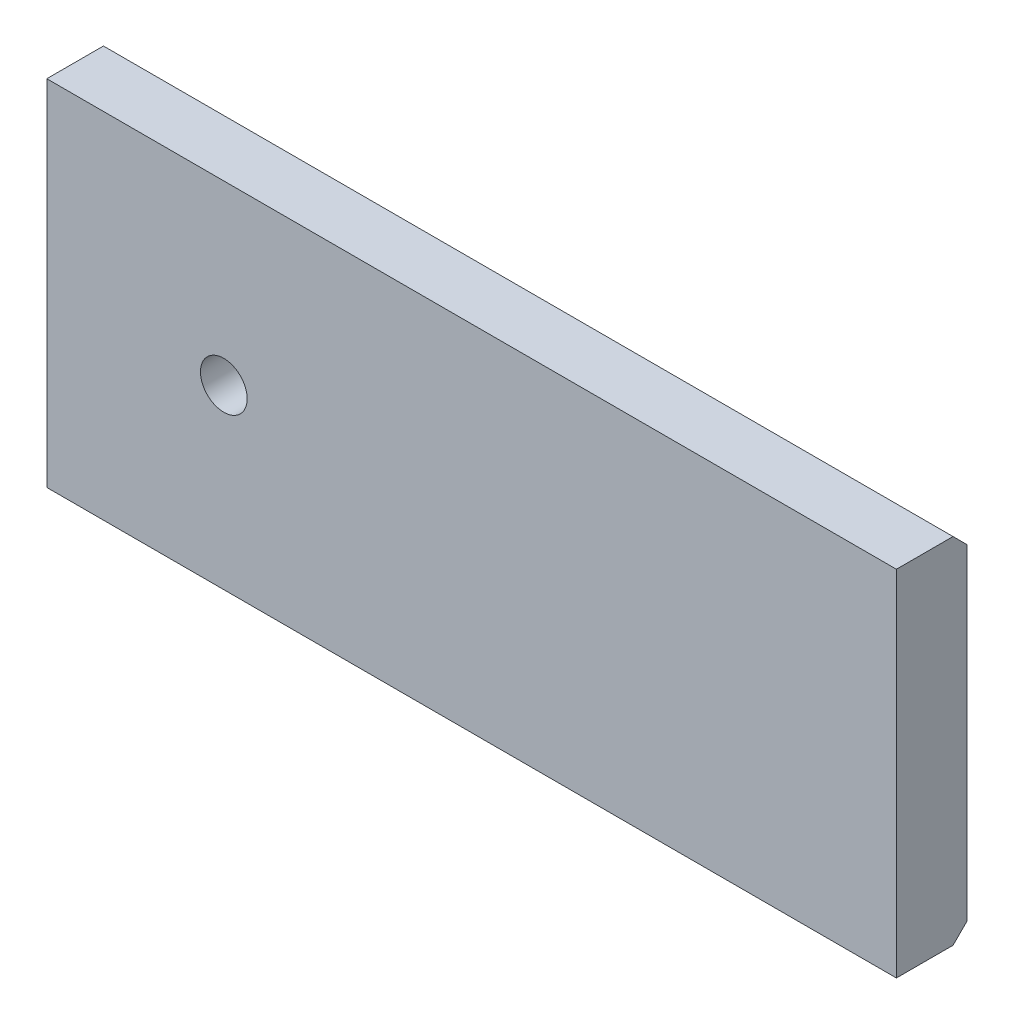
from build123d import *

# Parameters (mm, degrees)
ESQUISSE1_W             = 120
ESQUISSE1_H             = 50
BOSS_EXTRU_1_DEPTH      = 10
ESQUISSE2_R             = 3.299192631
ENL_V_MAT_EXTRU_1_DEPTH = 123.983738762
CHANFREIN1_SIZE         = 2


with BuildPart() as part:
    # Esquisse1 → Boss.-Extru.1 (new body)
    with BuildSketch(Plane.XY):
        with Locations((60, 0)):
            Rectangle(ESQUISSE1_W, ESQUISSE1_H)
    extrude(amount=BOSS_EXTRU_1_DEPTH)

    # Esquisse2 → Enl_v. mat.-Extru.1 (cut, through all)
    with BuildSketch(Plane(origin=(0, 0, 0), x_dir=(-1, 0, 0), z_dir=(0, 0, -1))):
        with Locations((-25, 0)):
            Circle(ESQUISSE2_R)
    extrude(amount=-ENL_V_MAT_EXTRU_1_DEPTH, mode=Mode.SUBTRACT)

    # Chanfrein1
    chanfrein1_edges = [part.edges().sort_by_distance(p)[0] for p in [
        (60, 25, 0),
        (60, -25, 0),
    ]]
    chamfer(chanfrein1_edges, length=CHANFREIN1_SIZE)


solid = part.part
